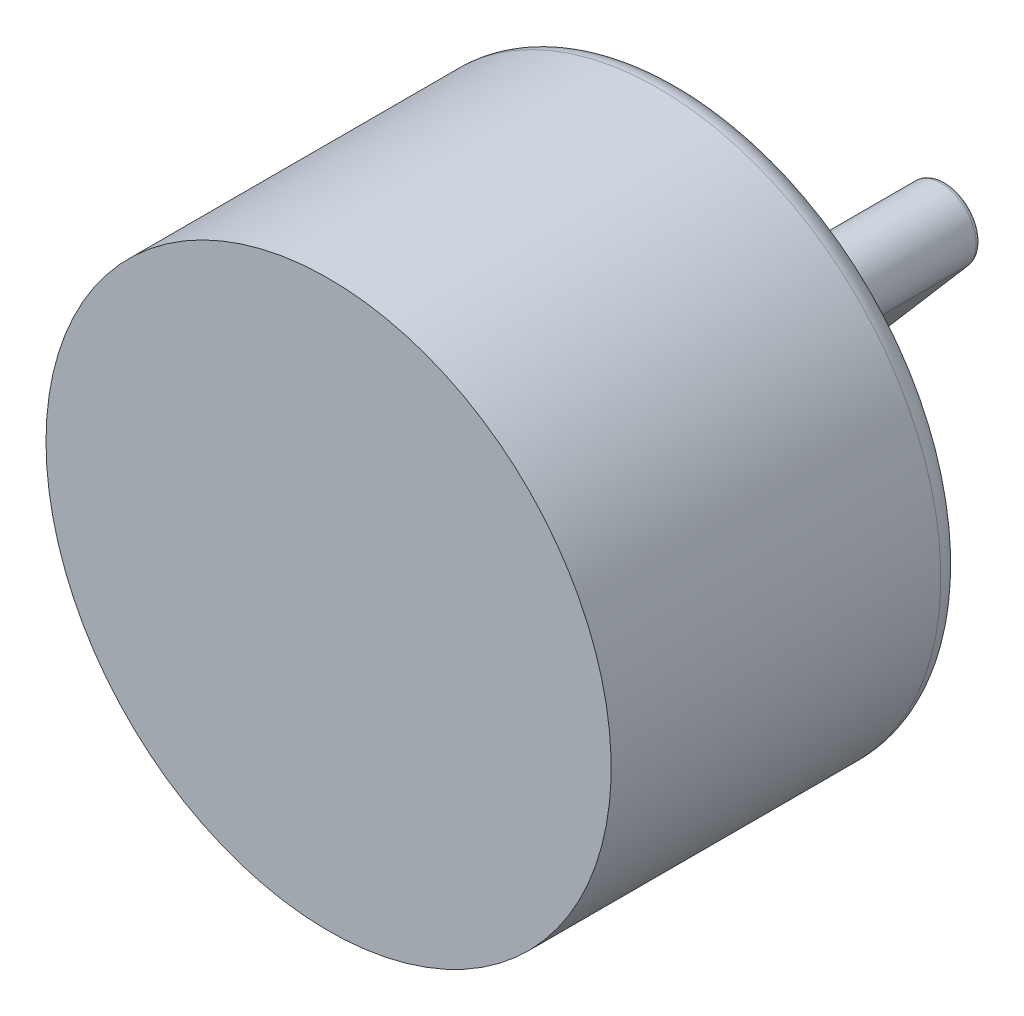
ISO-10303-21;
HEADER;
FILE_DESCRIPTION(('STEP AP214'),'2;1');
FILE_NAME('part.step','',(''),(''),'','','');
FILE_SCHEMA(('AUTOMOTIVE_DESIGN { 1 0 10303 214 1 1 1 1 }'));
ENDSEC;
DATA;
#1=APPLICATION_CONTEXT('core data for automotive mechanical design processes');
#2=APPLICATION_PROTOCOL_DEFINITION('international standard','automotive_design',2000,#1);
#3=PRODUCT_CONTEXT('',#1,'mechanical');
#4=PRODUCT('Part','Part','',(#3));
#5=PRODUCT_RELATED_PRODUCT_CATEGORY('part','',(#4));
#6=PRODUCT_DEFINITION_FORMATION('','',#4);
#7=PRODUCT_DEFINITION_CONTEXT('part definition',#1,'design');
#8=PRODUCT_DEFINITION('design','',#6,#7);
#9=PRODUCT_DEFINITION_SHAPE('','',#8);
#10=(LENGTH_UNIT() NAMED_UNIT(*) SI_UNIT(.MILLI.,.METRE.));
#11=(NAMED_UNIT(*) PLANE_ANGLE_UNIT() SI_UNIT($,.RADIAN.));
#12=(NAMED_UNIT(*) SI_UNIT($,.STERADIAN.) SOLID_ANGLE_UNIT());
#13=UNCERTAINTY_MEASURE_WITH_UNIT(LENGTH_MEASURE(1.E-05),#10,'distance_accuracy_value','');
#14=(GEOMETRIC_REPRESENTATION_CONTEXT(3) GLOBAL_UNCERTAINTY_ASSIGNED_CONTEXT((#13)) GLOBAL_UNIT_ASSIGNED_CONTEXT((#10,
#11,#12)) REPRESENTATION_CONTEXT('',''));
#15=CARTESIAN_POINT('',(0.,0.,0.));
#16=DIRECTION('',(0.,0.,1.));
#17=DIRECTION('',(1.,0.,0.));
#18=AXIS2_PLACEMENT_3D('',#15,#16,#17);
#19=CARTESIAN_POINT('',(-7.33178412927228,-6.22454347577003,-24.));
#20=DIRECTION('',(0.758171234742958,-0.65205550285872,0.));
#21=DIRECTION('',(0.65205550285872,0.758171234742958,0.));
#22=AXIS2_PLACEMENT_3D('',#19,#20,#21);
#23=PLANE('',#22);
#24=DIRECTION('',(0.,0.,1.));
#25=VECTOR('',#24,1.);
#26=CARTESIAN_POINT('',(5.0572704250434,8.18070998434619,-24.));
#27=LINE('',#26,#25);
#28=CARTESIAN_POINT('',(5.0572704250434,8.18070998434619,-23.8));
#29=VERTEX_POINT('',#28);
#30=CARTESIAN_POINT('',(5.0572704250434,8.18070998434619,-19.));
#31=VERTEX_POINT('',#30);
#32=EDGE_CURVE('E173',#29,#31,#27,.T.);
#33=ORIENTED_EDGE('',*,*,#32,.F.);
#34=DIRECTION('',(0.65205550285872,0.758171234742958,0.));
#35=VECTOR('',#34,1.);
#36=CARTESIAN_POINT('',(0.924723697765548,3.37563121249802,-23.8));
#37=LINE('',#36,#35);
#38=CARTESIAN_POINT('',(0.924723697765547,3.37563121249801,-23.8));
#39=VERTEX_POINT('',#38);
#40=EDGE_CURVE('E152',#29,#39,#37,.F.);
#41=ORIENTED_EDGE('',*,*,#40,.T.);
#42=DIRECTION('',(0.,0.,1.));
#43=VECTOR('',#42,1.);
#44=CARTESIAN_POINT('',(0.924723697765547,3.37563121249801,-24.));
#45=LINE('',#44,#43);
#46=CARTESIAN_POINT('',(0.924723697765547,3.37563121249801,-19.));
#47=VERTEX_POINT('',#46);
#48=EDGE_CURVE('E136',#47,#39,#45,.F.);
#49=ORIENTED_EDGE('',*,*,#48,.F.);
#50=DIRECTION('',(0.65205550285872,0.758171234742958,0.));
#51=VECTOR('',#50,1.);
#52=CARTESIAN_POINT('',(-7.33178412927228,-6.22454347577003,-19.));
#53=LINE('',#52,#51);
#54=EDGE_CURVE('E149',#47,#31,#53,.T.);
#55=ORIENTED_EDGE('',*,*,#54,.T.);
#56=EDGE_LOOP('',(#33,#41,#49,#55));
#57=FACE_BOUND('',#56,.T.);
#58=ADVANCED_FACE('F36',(#57),#23,.F.);
#59=DIRECTION('',(0.,0.,1.));
#60=VECTOR('',#59,1.);
#61=CARTESIAN_POINT('',(-3.19923740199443,-1.41946470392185,-24.));
#62=LINE('',#61,#60);
#63=CARTESIAN_POINT('',(-3.19923740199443,-1.41946470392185,-23.8));
#64=VERTEX_POINT('',#63);
#65=CARTESIAN_POINT('',(-3.19923740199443,-1.41946470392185,-19.));
#66=VERTEX_POINT('',#65);
#67=EDGE_CURVE('E139',#64,#66,#62,.T.);
#68=ORIENTED_EDGE('',*,*,#67,.F.);
#69=DIRECTION('',(0.65205550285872,0.758171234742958,0.));
#70=VECTOR('',#69,1.);
#71=CARTESIAN_POINT('',(-7.33178412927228,-6.22454347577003,-23.8));
#72=LINE('',#71,#70);
#73=CARTESIAN_POINT('',(-7.33178412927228,-6.22454347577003,-23.8));
#74=VERTEX_POINT('',#73);
#75=EDGE_CURVE('E210',#64,#74,#72,.F.);
#76=ORIENTED_EDGE('',*,*,#75,.T.);
#77=DIRECTION('',(0.,0.,1.));
#78=VECTOR('',#77,1.);
#79=CARTESIAN_POINT('',(-7.33178412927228,-6.22454347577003,-24.));
#80=LINE('',#79,#78);
#81=CARTESIAN_POINT('',(-7.33178412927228,-6.22454347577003,-19.));
#82=VERTEX_POINT('',#81);
#83=EDGE_CURVE('E175',#74,#82,#80,.T.);
#84=ORIENTED_EDGE('',*,*,#83,.T.);
#85=EDGE_CURVE('E158',#82,#66,#53,.T.);
#86=ORIENTED_EDGE('',*,*,#85,.T.);
#87=EDGE_LOOP('',(#68,#76,#84,#86));
#88=FACE_BOUND('',#87,.T.);
#89=ADVANCED_FACE('F282',(#88),#23,.F.);
#90=CARTESIAN_POINT('',(-5.05727042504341,-8.18070998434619,-24.));
#91=DIRECTION('',(-0.758171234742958,0.65205550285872,0.));
#92=DIRECTION('',(-0.65205550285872,-0.758171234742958,0.));
#93=AXIS2_PLACEMENT_3D('',#90,#91,#92);
#94=PLANE('',#93);
#95=DIRECTION('',(0.,0.,1.));
#96=VECTOR('',#95,1.);
#97=CARTESIAN_POINT('',(-5.05727042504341,-8.18070998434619,-24.));
#98=LINE('',#97,#96);
#99=CARTESIAN_POINT('',(-5.05727042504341,-8.18070998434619,-23.8));
#100=VERTEX_POINT('',#99);
#101=CARTESIAN_POINT('',(-5.05727042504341,-8.18070998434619,-19.));
#102=VERTEX_POINT('',#101);
#103=EDGE_CURVE('E169',#100,#102,#98,.T.);
#104=ORIENTED_EDGE('',*,*,#103,.F.);
#105=DIRECTION('',(-0.65205550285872,-0.758171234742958,0.));
#106=VECTOR('',#105,1.);
#107=CARTESIAN_POINT('',(-0.924723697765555,-3.37563121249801,-23.8));
#108=LINE('',#107,#106);
#109=CARTESIAN_POINT('',(-0.924723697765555,-3.37563121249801,-23.8));
#110=VERTEX_POINT('',#109);
#111=EDGE_CURVE('E60',#100,#110,#108,.F.);
#112=ORIENTED_EDGE('',*,*,#111,.T.);
#113=DIRECTION('',(0.,0.,1.));
#114=VECTOR('',#113,1.);
#115=CARTESIAN_POINT('',(-0.924723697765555,-3.37563121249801,-24.));
#116=LINE('',#115,#114);
#117=CARTESIAN_POINT('',(-0.924723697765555,-3.37563121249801,-19.));
#118=VERTEX_POINT('',#117);
#119=EDGE_CURVE('E360',#118,#110,#116,.F.);
#120=ORIENTED_EDGE('',*,*,#119,.F.);
#121=DIRECTION('',(-0.65205550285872,-0.758171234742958,0.));
#122=VECTOR('',#121,1.);
#123=CARTESIAN_POINT('',(-5.05727042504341,-8.18070998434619,-19.));
#124=LINE('',#123,#122);
#125=EDGE_CURVE('E165',#118,#102,#124,.T.);
#126=ORIENTED_EDGE('',*,*,#125,.T.);
#127=EDGE_LOOP('',(#104,#112,#120,#126));
#128=FACE_BOUND('',#127,.T.);
#129=ADVANCED_FACE('F287',(#128),#94,.F.);
#130=DIRECTION('',(0.,0.,1.));
#131=VECTOR('',#130,1.);
#132=CARTESIAN_POINT('',(3.19923740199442,1.41946470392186,-24.));
#133=LINE('',#132,#131);
#134=CARTESIAN_POINT('',(3.19923740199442,1.41946470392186,-23.8));
#135=VERTEX_POINT('',#134);
#136=CARTESIAN_POINT('',(3.19923740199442,1.41946470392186,-19.));
#137=VERTEX_POINT('',#136);
#138=EDGE_CURVE('E330',#135,#137,#133,.T.);
#139=ORIENTED_EDGE('',*,*,#138,.F.);
#140=DIRECTION('',(-0.65205550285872,-0.758171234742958,0.));
#141=VECTOR('',#140,1.);
#142=CARTESIAN_POINT('',(7.33178412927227,6.22454347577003,-23.8));
#143=LINE('',#142,#141);
#144=CARTESIAN_POINT('',(7.33178412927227,6.22454347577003,-23.8));
#145=VERTEX_POINT('',#144);
#146=EDGE_CURVE('E11',#135,#145,#143,.F.);
#147=ORIENTED_EDGE('',*,*,#146,.T.);
#148=DIRECTION('',(0.,0.,1.));
#149=VECTOR('',#148,1.);
#150=CARTESIAN_POINT('',(7.33178412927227,6.22454347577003,-24.));
#151=LINE('',#150,#149);
#152=CARTESIAN_POINT('',(7.33178412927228,6.22454347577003,-19.));
#153=VERTEX_POINT('',#152);
#154=EDGE_CURVE('E171',#145,#153,#151,.T.);
#155=ORIENTED_EDGE('',*,*,#154,.T.);
#156=EDGE_CURVE('E166',#153,#137,#124,.T.);
#157=ORIENTED_EDGE('',*,*,#156,.T.);
#158=EDGE_LOOP('',(#139,#147,#155,#157));
#159=FACE_BOUND('',#158,.T.);
#160=ADVANCED_FACE('F301',(#159),#94,.F.);
#161=CARTESIAN_POINT('',(0.,0.,-19.));
#162=DIRECTION('',(0.,0.,-1.));
#163=DIRECTION('',(-1.,0.,0.));
#164=AXIS2_PLACEMENT_3D('',#161,#162,#163);
#165=PLANE('',#164);
#166=ORIENTED_EDGE('',*,*,#54,.F.);
#167=CARTESIAN_POINT('',(0.,0.,-19.));
#168=DIRECTION('',(0.,0.,-1.));
#169=DIRECTION('',(-1.,0.,0.));
#170=AXIS2_PLACEMENT_3D('',#167,#168,#169);
#171=CIRCLE('',#170,3.5);
#172=EDGE_CURVE('E133',#66,#47,#171,.T.);
#173=ORIENTED_EDGE('',*,*,#172,.F.);
#174=ORIENTED_EDGE('',*,*,#85,.F.);
#175=CARTESIAN_POINT('',(-6.19452727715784,-7.20262673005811,-19.));
#176=DIRECTION('',(0.,0.,-1.));
#177=DIRECTION('',(-1.,0.,0.));
#178=AXIS2_PLACEMENT_3D('',#175,#176,#177);
#179=CIRCLE('',#178,1.5);
#180=CARTESIAN_POINT('',(-7.17261053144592,-8.33988358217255,-19.));
#181=VERTEX_POINT('',#180);
#182=EDGE_CURVE('E153',#181,#82,#179,.T.);
#183=ORIENTED_EDGE('',*,*,#182,.F.);
#184=CARTESIAN_POINT('',(0.,0.,-19.));
#185=DIRECTION('',(0.,0.,-1.));
#186=DIRECTION('',(-1.,0.,0.));
#187=AXIS2_PLACEMENT_3D('',#184,#185,#186);
#188=CIRCLE('',#187,11.);
#189=CARTESIAN_POINT('',(7.17261053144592,8.33988358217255,-19.));
#190=VERTEX_POINT('',#189);
#191=EDGE_CURVE('E180',#181,#190,#188,.T.);
#192=ORIENTED_EDGE('',*,*,#191,.T.);
#193=CARTESIAN_POINT('',(6.19452727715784,7.20262673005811,-19.));
#194=DIRECTION('',(0.,0.,-1.));
#195=DIRECTION('',(-1.,0.,0.));
#196=AXIS2_PLACEMENT_3D('',#193,#194,#195);
#197=CIRCLE('',#196,1.5);
#198=EDGE_CURVE('E157',#31,#190,#197,.T.);
#199=ORIENTED_EDGE('',*,*,#198,.F.);
#200=EDGE_LOOP('',(#166,#173,#174,#183,#192,#199));
#201=FACE_BOUND('',#200,.T.);
#202=ADVANCED_FACE('F155',(#201),#165,.T.);
#203=ORIENTED_EDGE('',*,*,#125,.F.);
#204=EDGE_CURVE('E144',#137,#118,#171,.T.);
#205=ORIENTED_EDGE('',*,*,#204,.F.);
#206=ORIENTED_EDGE('',*,*,#156,.F.);
#207=EDGE_CURVE('E161',#190,#153,#197,.T.);
#208=ORIENTED_EDGE('',*,*,#207,.F.);
#209=EDGE_CURVE('E181',#190,#181,#188,.T.);
#210=ORIENTED_EDGE('',*,*,#209,.T.);
#211=EDGE_CURVE('E159',#102,#181,#179,.T.);
#212=ORIENTED_EDGE('',*,*,#211,.F.);
#213=EDGE_LOOP('',(#203,#205,#206,#208,#210,#212));
#214=FACE_BOUND('',#213,.T.);
#215=ADVANCED_FACE('F300',(#214),#165,.T.);
#216=CARTESIAN_POINT('',(0.,0.,-19.));
#217=DIRECTION('',(0.,0.,1.));
#218=DIRECTION('',(1.,0.,0.));
#219=AXIS2_PLACEMENT_3D('',#216,#217,#218);
#220=CYLINDRICAL_SURFACE('',#219,12.);
#221=CARTESIAN_POINT('',(0.,0.,-18.));
#222=DIRECTION('',(0.,0.,-1.));
#223=DIRECTION('',(-1.,0.,0.));
#224=AXIS2_PLACEMENT_3D('',#221,#222,#223);
#225=CIRCLE('',#224,12.);
#226=CARTESIAN_POINT('',(-12.,0.,-18.));
#227=VERTEX_POINT('',#226);
#228=EDGE_CURVE('E184',#227,#227,#225,.F.);
#229=ORIENTED_EDGE('',*,*,#228,.T.);
#230=EDGE_LOOP('',(#229));
#231=FACE_BOUND('',#230,.T.);
#232=CARTESIAN_POINT('',(0.,0.,-4.));
#233=DIRECTION('',(0.,0.,-1.));
#234=DIRECTION('',(-1.,0.,0.));
#235=AXIS2_PLACEMENT_3D('',#232,#233,#234);
#236=CIRCLE('',#235,12.);
#237=CARTESIAN_POINT('',(-12.,0.,-4.));
#238=VERTEX_POINT('',#237);
#239=EDGE_CURVE('E177',#238,#238,#236,.T.);
#240=ORIENTED_EDGE('',*,*,#239,.T.);
#241=EDGE_LOOP('',(#240));
#242=FACE_BOUND('',#241,.T.);
#243=ADVANCED_FACE('F305',(#231,#242),#220,.T.);
#244=CARTESIAN_POINT('',(0.,0.,-4.));
#245=DIRECTION('',(0.,0.,-1.));
#246=DIRECTION('',(-1.,0.,0.));
#247=AXIS2_PLACEMENT_3D('',#244,#245,#246);
#248=PLANE('',#247);
#249=ORIENTED_EDGE('',*,*,#239,.F.);
#250=EDGE_LOOP('',(#249));
#251=FACE_BOUND('',#250,.T.);
#252=ADVANCED_FACE('F302',(#251),#248,.F.);
#253=CARTESIAN_POINT('',(0.,0.,-18.));
#254=DIRECTION('',(0.,0.,-1.));
#255=DIRECTION('',(-1.,0.,0.));
#256=AXIS2_PLACEMENT_3D('',#253,#254,#255);
#257=TOROIDAL_SURFACE('',#256,11.,1.);
#258=ORIENTED_EDGE('',*,*,#228,.F.);
#259=EDGE_LOOP('',(#258));
#260=FACE_BOUND('',#259,.T.);
#261=ORIENTED_EDGE('',*,*,#209,.F.);
#262=ORIENTED_EDGE('',*,*,#191,.F.);
#263=EDGE_LOOP('',(#261,#262));
#264=FACE_BOUND('',#263,.T.);
#265=ADVANCED_FACE('F296',(#260,#264),#257,.T.);
#266=CARTESIAN_POINT('',(-6.19452727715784,-7.20262673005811,-24.));
#267=DIRECTION('',(0.,0.,1.));
#268=DIRECTION('',(1.,0.,0.));
#269=AXIS2_PLACEMENT_3D('',#266,#267,#268);
#270=CYLINDRICAL_SURFACE('',#269,1.5);
#271=ORIENTED_EDGE('',*,*,#83,.F.);
#272=CARTESIAN_POINT('',(-6.19452727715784,-7.20262673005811,-23.8));
#273=DIRECTION('',(0.,0.,-1.));
#274=DIRECTION('',(-1.,0.,0.));
#275=AXIS2_PLACEMENT_3D('',#272,#273,#274);
#276=CIRCLE('',#275,1.5);
#277=EDGE_CURVE('E212',#74,#100,#276,.F.);
#278=ORIENTED_EDGE('',*,*,#277,.T.);
#279=ORIENTED_EDGE('',*,*,#103,.T.);
#280=ORIENTED_EDGE('',*,*,#211,.T.);
#281=ORIENTED_EDGE('',*,*,#182,.T.);
#282=EDGE_LOOP('',(#271,#278,#279,#280,#281));
#283=FACE_BOUND('',#282,.T.);
#284=ADVANCED_FACE('F293',(#283),#270,.T.);
#285=CARTESIAN_POINT('',(6.19452727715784,7.20262673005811,-24.));
#286=DIRECTION('',(0.,0.,1.));
#287=DIRECTION('',(1.,0.,0.));
#288=AXIS2_PLACEMENT_3D('',#285,#286,#287);
#289=CYLINDRICAL_SURFACE('',#288,1.5);
#290=ORIENTED_EDGE('',*,*,#154,.F.);
#291=CARTESIAN_POINT('',(6.19452727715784,7.20262673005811,-23.8));
#292=DIRECTION('',(0.,0.,-1.));
#293=DIRECTION('',(-1.,0.,0.));
#294=AXIS2_PLACEMENT_3D('',#291,#292,#293);
#295=CIRCLE('',#294,1.5);
#296=EDGE_CURVE('E204',#145,#29,#295,.F.);
#297=ORIENTED_EDGE('',*,*,#296,.T.);
#298=ORIENTED_EDGE('',*,*,#32,.T.);
#299=ORIENTED_EDGE('',*,*,#198,.T.);
#300=ORIENTED_EDGE('',*,*,#207,.T.);
#301=EDGE_LOOP('',(#290,#297,#298,#299,#300));
#302=FACE_BOUND('',#301,.T.);
#303=ADVANCED_FACE('F291',(#302),#289,.T.);
#304=CARTESIAN_POINT('',(-6.19452727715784,-7.20262673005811,-24.));
#305=DIRECTION('',(0.,0.,-1.));
#306=DIRECTION('',(-1.,0.,0.));
#307=AXIS2_PLACEMENT_3D('',#304,#305,#306);
#308=PLANE('',#307);
#309=DIRECTION('',(0.65205550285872,0.758171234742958,0.));
#310=VECTOR('',#309,1.);
#311=CARTESIAN_POINT('',(5.20890467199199,8.05029888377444,-24.));
#312=LINE('',#311,#310);
#313=CARTESIAN_POINT('',(0.992159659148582,3.14731936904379,-24.));
#314=VERTEX_POINT('',#313);
#315=CARTESIAN_POINT('',(5.20890467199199,8.05029888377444,-24.));
#316=VERTEX_POINT('',#315);
#317=EDGE_CURVE('E199',#314,#316,#312,.T.);
#318=ORIENTED_EDGE('',*,*,#317,.T.);
#319=CARTESIAN_POINT('',(6.19452727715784,7.20262673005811,-24.));
#320=DIRECTION('',(0.,0.,-1.));
#321=DIRECTION('',(-1.,0.,0.));
#322=AXIS2_PLACEMENT_3D('',#319,#320,#321);
#323=CIRCLE('',#322,1.3);
#324=CARTESIAN_POINT('',(7.18014988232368,6.35495457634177,-24.));
#325=VERTEX_POINT('',#324);
#326=EDGE_CURVE('E201',#316,#325,#323,.T.);
#327=ORIENTED_EDGE('',*,*,#326,.T.);
#328=DIRECTION('',(-0.65205550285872,-0.758171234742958,0.));
#329=VECTOR('',#328,1.);
#330=CARTESIAN_POINT('',(3.04760315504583,1.5498758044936,-24.));
#331=LINE('',#330,#329);
#332=CARTESIAN_POINT('',(2.96340486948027,1.45197506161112,-24.));
#333=VERTEX_POINT('',#332);
#334=EDGE_CURVE('E187',#325,#333,#331,.T.);
#335=ORIENTED_EDGE('',*,*,#334,.T.);
#336=CARTESIAN_POINT('',(0.,0.,-24.));
#337=DIRECTION('',(0.,0.,-1.));
#338=DIRECTION('',(-1.,0.,0.));
#339=AXIS2_PLACEMENT_3D('',#336,#337,#338);
#340=CIRCLE('',#339,3.3);
#341=CARTESIAN_POINT('',(-0.992159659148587,-3.14731936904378,-24.));
#342=VERTEX_POINT('',#341);
#343=EDGE_CURVE('E189',#333,#342,#340,.T.);
#344=ORIENTED_EDGE('',*,*,#343,.T.);
#345=DIRECTION('',(-0.65205550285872,-0.758171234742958,0.));
#346=VECTOR('',#345,1.);
#347=CARTESIAN_POINT('',(-5.208904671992,-8.05029888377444,-24.));
#348=LINE('',#347,#346);
#349=CARTESIAN_POINT('',(-5.208904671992,-8.05029888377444,-24.));
#350=VERTEX_POINT('',#349);
#351=EDGE_CURVE('E191',#342,#350,#348,.T.);
#352=ORIENTED_EDGE('',*,*,#351,.T.);
#353=CARTESIAN_POINT('',(-6.19452727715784,-7.20262673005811,-24.));
#354=DIRECTION('',(0.,0.,-1.));
#355=DIRECTION('',(-1.,0.,0.));
#356=AXIS2_PLACEMENT_3D('',#353,#354,#355);
#357=CIRCLE('',#356,1.3);
#358=CARTESIAN_POINT('',(-7.18014988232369,-6.35495457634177,-24.));
#359=VERTEX_POINT('',#358);
#360=EDGE_CURVE('E193',#350,#359,#357,.T.);
#361=ORIENTED_EDGE('',*,*,#360,.T.);
#362=DIRECTION('',(0.65205550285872,0.758171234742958,0.));
#363=VECTOR('',#362,1.);
#364=CARTESIAN_POINT('',(-3.04760315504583,-1.54987580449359,-24.));
#365=LINE('',#364,#363);
#366=CARTESIAN_POINT('',(-2.96340486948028,-1.45197506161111,-24.));
#367=VERTEX_POINT('',#366);
#368=EDGE_CURVE('E195',#359,#367,#365,.T.);
#369=ORIENTED_EDGE('',*,*,#368,.T.);
#370=CARTESIAN_POINT('',(0.,0.,-24.));
#371=DIRECTION('',(0.,0.,-1.));
#372=DIRECTION('',(-1.,0.,0.));
#373=AXIS2_PLACEMENT_3D('',#370,#371,#372);
#374=CIRCLE('',#373,3.3);
#375=EDGE_CURVE('E197',#367,#314,#374,.T.);
#376=ORIENTED_EDGE('',*,*,#375,.T.);
#377=EDGE_LOOP('',(#318,#327,#335,#344,#352,#361,#369,#376));
#378=FACE_BOUND('',#377,.T.);
#379=ADVANCED_FACE('F335',(#378),#308,.T.);
#380=CARTESIAN_POINT('',(0.,0.,-24.));
#381=DIRECTION('',(0.,0.,1.));
#382=DIRECTION('',(1.,0.,0.));
#383=AXIS2_PLACEMENT_3D('',#380,#381,#382);
#384=CYLINDRICAL_SURFACE('',#383,3.5);
#385=ORIENTED_EDGE('',*,*,#119,.T.);
#386=CARTESIAN_POINT('',(0.,0.,-23.8));
#387=DIRECTION('',(0.,0.,-1.));
#388=DIRECTION('',(-1.,0.,0.));
#389=AXIS2_PLACEMENT_3D('',#386,#387,#388);
#390=CIRCLE('',#389,3.5);
#391=EDGE_CURVE('E45',#110,#135,#390,.F.);
#392=ORIENTED_EDGE('',*,*,#391,.T.);
#393=ORIENTED_EDGE('',*,*,#138,.T.);
#394=ORIENTED_EDGE('',*,*,#204,.T.);
#395=EDGE_LOOP('',(#385,#392,#393,#394));
#396=FACE_BOUND('',#395,.T.);
#397=ADVANCED_FACE('F364',(#396),#384,.T.);
#398=ORIENTED_EDGE('',*,*,#48,.T.);
#399=CARTESIAN_POINT('',(0.,0.,-23.8));
#400=DIRECTION('',(0.,0.,-1.));
#401=DIRECTION('',(-1.,0.,0.));
#402=AXIS2_PLACEMENT_3D('',#399,#400,#401);
#403=CIRCLE('',#402,3.5);
#404=EDGE_CURVE('E208',#39,#64,#403,.F.);
#405=ORIENTED_EDGE('',*,*,#404,.T.);
#406=ORIENTED_EDGE('',*,*,#67,.T.);
#407=ORIENTED_EDGE('',*,*,#172,.T.);
#408=EDGE_LOOP('',(#398,#405,#406,#407));
#409=FACE_BOUND('',#408,.T.);
#410=ADVANCED_FACE('F135',(#409),#384,.T.);
#411=CARTESIAN_POINT('',(-6.19452727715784,-7.20262673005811,-23.8));
#412=DIRECTION('',(0.,0.,-1.));
#413=DIRECTION('',(-1.,0.,0.));
#414=AXIS2_PLACEMENT_3D('',#411,#412,#413);
#415=TOROIDAL_SURFACE('',#414,1.3,0.2);
#416=CARTESIAN_POINT('',(-5.208904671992,-8.05029888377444,-23.8));
#417=DIRECTION('',(0.652055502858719,0.758171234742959,0.));
#418=DIRECTION('',(-0.758171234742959,0.652055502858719,0.));
#419=AXIS2_PLACEMENT_3D('',#416,#417,#418);
#420=CIRCLE('',#419,0.2);
#421=EDGE_CURVE('E264',#100,#350,#420,.T.);
#422=ORIENTED_EDGE('',*,*,#421,.F.);
#423=ORIENTED_EDGE('',*,*,#277,.F.);
#424=CARTESIAN_POINT('',(-7.18014988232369,-6.35495457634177,-23.8));
#425=DIRECTION('',(0.652055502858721,0.758171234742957,0.));
#426=DIRECTION('',(-0.758171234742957,0.652055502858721,0.));
#427=AXIS2_PLACEMENT_3D('',#424,#425,#426);
#428=CIRCLE('',#427,0.2);
#429=EDGE_CURVE('E40',#359,#74,#428,.T.);
#430=ORIENTED_EDGE('',*,*,#429,.F.);
#431=ORIENTED_EDGE('',*,*,#360,.F.);
#432=EDGE_LOOP('',(#422,#423,#430,#431));
#433=FACE_BOUND('',#432,.T.);
#434=ADVANCED_FACE('F38',(#433),#415,.T.);
#435=CARTESIAN_POINT('',(-7.18014988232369,-6.35495457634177,-23.8));
#436=DIRECTION('',(-0.65205550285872,-0.758171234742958,0.));
#437=DIRECTION('',(0.758171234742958,-0.65205550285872,0.));
#438=AXIS2_PLACEMENT_3D('',#435,#436,#437);
#439=CYLINDRICAL_SURFACE('',#438,0.2);
#440=ORIENTED_EDGE('',*,*,#429,.T.);
#441=ORIENTED_EDGE('',*,*,#75,.F.);
#442=CARTESIAN_POINT('',(-3.19923740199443,-1.41946470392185,-23.8));
#443=CARTESIAN_POINT('',(-3.19925312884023,-1.41946204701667,-23.8100040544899));
#444=CARTESIAN_POINT('',(-3.19835991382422,-1.41959405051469,-23.8199955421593));
#445=CARTESIAN_POINT('',(-3.19488388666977,-1.42010588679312,-23.8396265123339));
#446=CARTESIAN_POINT('',(-3.19230913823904,-1.42048453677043,-23.8492674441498));
#447=CARTESIAN_POINT('',(-3.18559963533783,-1.42146803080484,-23.8679613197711));
#448=CARTESIAN_POINT('',(-3.18146649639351,-1.42207264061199,-23.8770148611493));
#449=CARTESIAN_POINT('',(-3.1718324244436,-1.42347552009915,-23.894350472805));
#450=CARTESIAN_POINT('',(-3.16633018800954,-1.42427397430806,-23.9026317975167));
#451=CARTESIAN_POINT('',(-3.15382621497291,-1.42607839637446,-23.9187189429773));
#452=CARTESIAN_POINT('',(-3.14675710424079,-1.42709356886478,-23.9264711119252));
#453=CARTESIAN_POINT('',(-3.13157968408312,-1.42925815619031,-23.9408513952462));
#454=CARTESIAN_POINT('',(-3.12347113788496,-1.43040760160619,-23.9474792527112));
#455=CARTESIAN_POINT('',(-3.10518988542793,-1.43297906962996,-23.9604517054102));
#456=CARTESIAN_POINT('',(-3.09488885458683,-1.43441634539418,-23.9666122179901));
#457=CARTESIAN_POINT('',(-3.0735072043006,-1.4373703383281,-23.9773767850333));
#458=CARTESIAN_POINT('',(-3.0624256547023,-1.43888714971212,-23.9819789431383));
#459=CARTESIAN_POINT('',(-3.03744416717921,-1.44227022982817,-23.9904020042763));
#460=CARTESIAN_POINT('',(-3.02342824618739,-1.44414501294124,-23.99387546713));
#461=CARTESIAN_POINT('',(-2.99504925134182,-1.44788901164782,-23.9985902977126));
#462=CARTESIAN_POINT('',(-2.98068689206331,-1.44975823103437,-23.9998359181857));
#463=CARTESIAN_POINT('',(-2.96535567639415,-1.45172515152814,-23.9999949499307));
#464=CARTESIAN_POINT('',(-2.96438022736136,-1.45185017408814,-24.0000000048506));
#465=CARTESIAN_POINT('',(-2.96340486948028,-1.45197506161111,-24.));
#466=B_SPLINE_CURVE_WITH_KNOTS('',3,(#442,#443,#444,#445,#446,#447,#448,#449,#450,#451,#452,
#453,#454,#455,#456,#457,#458,#459,#460,#461,#462,#463,#464,#465),.UNSPECIFIED.,.F.,.F.,(4,2,2,
2,2,2,2,2,2,2,2,4),(0.,0.0299517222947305,0.0597608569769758,0.0895391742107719,
0.119345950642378,0.150844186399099,0.182349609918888,0.218475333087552,0.254644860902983,
0.298145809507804,0.341563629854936,0.344513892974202),.UNSPECIFIED.);
#467=EDGE_CURVE('E258',#367,#64,#466,.F.);
#468=ORIENTED_EDGE('',*,*,#467,.F.);
#469=ORIENTED_EDGE('',*,*,#368,.F.);
#470=EDGE_LOOP('',(#440,#441,#468,#469));
#471=FACE_BOUND('',#470,.T.);
#472=ADVANCED_FACE('F270',(#471),#439,.T.);
#473=CARTESIAN_POINT('',(-5.208904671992,-8.05029888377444,-23.8));
#474=DIRECTION('',(0.65205550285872,0.758171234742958,0.));
#475=DIRECTION('',(-0.758171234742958,0.65205550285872,0.));
#476=AXIS2_PLACEMENT_3D('',#473,#474,#475);
#477=CYLINDRICAL_SURFACE('',#476,0.2);
#478=ORIENTED_EDGE('',*,*,#421,.T.);
#479=ORIENTED_EDGE('',*,*,#351,.F.);
#480=CARTESIAN_POINT('',(-0.924723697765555,-3.37563121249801,-23.8));
#481=CARTESIAN_POINT('',(-0.924718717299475,-3.37564636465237,-23.8100040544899));
#482=CARTESIAN_POINT('',(-0.924982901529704,-3.37478296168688,-23.8199955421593));
#483=CARTESIAN_POINT('',(-0.926009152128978,-3.3714226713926,-23.8396265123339));
#484=CARTESIAN_POINT('',(-0.926768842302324,-3.36893357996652,-23.8492674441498));
#485=CARTESIAN_POINT('',(-0.928745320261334,-3.36244680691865,-23.8679613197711));
#486=CARTESIAN_POINT('',(-0.929961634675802,-3.35845068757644,-23.8770148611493));
#487=CARTESIAN_POINT('',(-0.932790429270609,-3.34913503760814,-23.894350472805));
#488=CARTESIAN_POINT('',(-0.934403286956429,-3.34381424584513,-23.9026317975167));
#489=CARTESIAN_POINT('',(-0.938058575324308,-3.33172110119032,-23.9187189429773));
#490=CARTESIAN_POINT('',(-0.940120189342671,-3.32488351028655,-23.9264711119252));
#491=CARTESIAN_POINT('',(-0.944531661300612,-3.31020092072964,-23.9408513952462));
#492=CARTESIAN_POINT('',(-0.946881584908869,-3.3023556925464,-23.9474792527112));
#493=CARTESIAN_POINT('',(-0.952159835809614,-3.28466511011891,-23.9604517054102));
#494=CARTESIAN_POINT('',(-0.955122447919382,-3.27469515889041,-23.9666122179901));
#495=CARTESIAN_POINT('',(-0.961242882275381,-3.25399633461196,-23.9773767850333));
#496=CARTESIAN_POINT('',(-0.964400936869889,-3.24326655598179,-23.9819789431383));
#497=CARTESIAN_POINT('',(-0.971484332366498,-3.21907264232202,-23.9904020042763));
#498=CARTESIAN_POINT('',(-0.975435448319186,-3.20549510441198,-23.99387546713));
#499=CARTESIAN_POINT('',(-0.98338412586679,-3.17799595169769,-23.9985902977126));
#500=CARTESIAN_POINT('',(-0.987381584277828,-3.16407504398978,-23.9998359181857));
#501=CARTESIAN_POINT('',(-0.991620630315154,-3.14921081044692,-23.9999949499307));
#502=CARTESIAN_POINT('',(-0.99189021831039,-3.14826505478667,-24.0000000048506));
#503=CARTESIAN_POINT('',(-0.992159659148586,-3.14731936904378,-24.));
#504=B_SPLINE_CURVE_WITH_KNOTS('',3,(#480,#481,#482,#483,#484,#485,#486,#487,#488,#489,#490,
#491,#492,#493,#494,#495,#496,#497,#498,#499,#500,#501,#502,#503),.UNSPECIFIED.,.F.,.F.,(4,2,2,
2,2,2,2,2,2,2,2,4),(0.,0.0299517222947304,0.0597608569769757,0.0895391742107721,
0.119345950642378,0.150844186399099,0.182349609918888,0.218475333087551,0.254644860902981,
0.298145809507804,0.341563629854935,0.344513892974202),.UNSPECIFIED.);
#505=EDGE_CURVE('E265',#110,#342,#504,.T.);
#506=ORIENTED_EDGE('',*,*,#505,.F.);
#507=ORIENTED_EDGE('',*,*,#111,.F.);
#508=EDGE_LOOP('',(#478,#479,#506,#507));
#509=FACE_BOUND('',#508,.T.);
#510=ADVANCED_FACE('F253',(#509),#477,.T.);
#511=CARTESIAN_POINT('',(0.,0.,-23.8));
#512=DIRECTION('',(0.,0.,-1.));
#513=DIRECTION('',(-1.,0.,0.));
#514=AXIS2_PLACEMENT_3D('',#511,#512,#513);
#515=TOROIDAL_SURFACE('',#514,3.3,0.2);
#516=ORIENTED_EDGE('',*,*,#467,.T.);
#517=ORIENTED_EDGE('',*,*,#404,.F.);
#518=CARTESIAN_POINT('',(0.924723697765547,3.37563121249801,-23.8));
#519=CARTESIAN_POINT('',(0.924718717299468,3.37564636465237,-23.8100040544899));
#520=CARTESIAN_POINT('',(0.924982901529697,3.37478296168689,-23.8199955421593));
#521=CARTESIAN_POINT('',(0.926009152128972,3.3714226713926,-23.8396265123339));
#522=CARTESIAN_POINT('',(0.926768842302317,3.36893357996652,-23.8492674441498));
#523=CARTESIAN_POINT('',(0.928745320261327,3.36244680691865,-23.8679613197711));
#524=CARTESIAN_POINT('',(0.929961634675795,3.35845068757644,-23.8770148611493));
#525=CARTESIAN_POINT('',(0.932790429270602,3.34913503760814,-23.894350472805));
#526=CARTESIAN_POINT('',(0.934403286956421,3.34381424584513,-23.9026317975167));
#527=CARTESIAN_POINT('',(0.938058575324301,3.33172110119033,-23.9187189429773));
#528=CARTESIAN_POINT('',(0.940120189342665,3.32488351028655,-23.9264711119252));
#529=CARTESIAN_POINT('',(0.944531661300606,3.31020092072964,-23.9408513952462));
#530=CARTESIAN_POINT('',(0.946881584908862,3.3023556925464,-23.9474792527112));
#531=CARTESIAN_POINT('',(0.952159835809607,3.28466511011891,-23.9604517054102));
#532=CARTESIAN_POINT('',(0.955122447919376,3.27469515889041,-23.9666122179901));
#533=CARTESIAN_POINT('',(0.961242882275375,3.25399633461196,-23.9773767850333));
#534=CARTESIAN_POINT('',(0.964400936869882,3.24326655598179,-23.9819789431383));
#535=CARTESIAN_POINT('',(0.971484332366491,3.21907264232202,-23.9904020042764));
#536=CARTESIAN_POINT('',(0.97543544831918,3.20549510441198,-23.99387546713));
#537=CARTESIAN_POINT('',(0.983384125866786,3.17799595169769,-23.9985902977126));
#538=CARTESIAN_POINT('',(0.987381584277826,3.16407504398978,-23.9998359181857));
#539=CARTESIAN_POINT('',(0.991620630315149,3.14921081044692,-23.9999949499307));
#540=CARTESIAN_POINT('',(0.991890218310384,3.14826505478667,-24.0000000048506));
#541=CARTESIAN_POINT('',(0.99215965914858,3.14731936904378,-24.));
#542=B_SPLINE_CURVE_WITH_KNOTS('',3,(#518,#519,#520,#521,#522,#523,#524,#525,#526,#527,#528,
#529,#530,#531,#532,#533,#534,#535,#536,#537,#538,#539,#540,#541),.UNSPECIFIED.,.F.,.F.,(4,2,2,
2,2,2,2,2,2,2,2,4),(0.,0.0299517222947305,0.0597608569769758,0.0895391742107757,
0.119345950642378,0.150844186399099,0.182349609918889,0.218475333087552,0.254644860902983,
0.298145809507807,0.341563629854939,0.344513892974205),.UNSPECIFIED.);
#543=EDGE_CURVE('E229',#314,#39,#542,.F.);
#544=ORIENTED_EDGE('',*,*,#543,.F.);
#545=ORIENTED_EDGE('',*,*,#375,.F.);
#546=EDGE_LOOP('',(#516,#517,#544,#545));
#547=FACE_BOUND('',#546,.T.);
#548=ADVANCED_FACE('F249',(#547),#515,.T.);
#549=CARTESIAN_POINT('',(0.,0.,-23.8));
#550=DIRECTION('',(0.,0.,-1.));
#551=DIRECTION('',(-1.,0.,0.));
#552=AXIS2_PLACEMENT_3D('',#549,#550,#551);
#553=TOROIDAL_SURFACE('',#552,3.3,0.2);
#554=ORIENTED_EDGE('',*,*,#505,.T.);
#555=ORIENTED_EDGE('',*,*,#343,.F.);
#556=CARTESIAN_POINT('',(3.19923740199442,1.41946470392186,-23.8));
#557=CARTESIAN_POINT('',(3.19925312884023,1.41946204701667,-23.8100040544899));
#558=CARTESIAN_POINT('',(3.19835991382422,1.4195940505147,-23.8199955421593));
#559=CARTESIAN_POINT('',(3.19488388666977,1.42010588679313,-23.8396265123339));
#560=CARTESIAN_POINT('',(3.19230913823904,1.42048453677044,-23.8492674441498));
#561=CARTESIAN_POINT('',(3.18559963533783,1.42146803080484,-23.8679613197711));
#562=CARTESIAN_POINT('',(3.18146649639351,1.422072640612,-23.8770148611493));
#563=CARTESIAN_POINT('',(3.1718324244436,1.42347552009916,-23.894350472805));
#564=CARTESIAN_POINT('',(3.16633018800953,1.42427397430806,-23.9026317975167));
#565=CARTESIAN_POINT('',(3.15382621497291,1.42607839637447,-23.9187189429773));
#566=CARTESIAN_POINT('',(3.14675710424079,1.42709356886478,-23.9264711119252));
#567=CARTESIAN_POINT('',(3.13157968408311,1.42925815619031,-23.9408513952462));
#568=CARTESIAN_POINT('',(3.12347113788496,1.43040760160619,-23.9474792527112));
#569=CARTESIAN_POINT('',(3.10518988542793,1.43297906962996,-23.9604517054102));
#570=CARTESIAN_POINT('',(3.09488885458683,1.43441634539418,-23.9666122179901));
#571=CARTESIAN_POINT('',(3.0735072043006,1.4373703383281,-23.9773767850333));
#572=CARTESIAN_POINT('',(3.0624256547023,1.43888714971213,-23.9819789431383));
#573=CARTESIAN_POINT('',(3.03744416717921,1.44227022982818,-23.9904020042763));
#574=CARTESIAN_POINT('',(3.02342824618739,1.44414501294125,-23.99387546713));
#575=CARTESIAN_POINT('',(2.99504925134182,1.44788901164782,-23.9985902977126));
#576=CARTESIAN_POINT('',(2.9806868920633,1.44975823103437,-23.9998359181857));
#577=CARTESIAN_POINT('',(2.96535567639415,1.45172515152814,-23.9999949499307));
#578=CARTESIAN_POINT('',(2.96438022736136,1.45185017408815,-24.0000000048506));
#579=CARTESIAN_POINT('',(2.96340486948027,1.45197506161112,-24.));
#580=B_SPLINE_CURVE_WITH_KNOTS('',3,(#556,#557,#558,#559,#560,#561,#562,#563,#564,#565,#566,
#567,#568,#569,#570,#571,#572,#573,#574,#575,#576,#577,#578,#579),.UNSPECIFIED.,.F.,.F.,(4,2,2,
2,2,2,2,2,2,2,2,4),(0.,0.0299517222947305,0.0597608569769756,0.0895391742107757,
0.119345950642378,0.150844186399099,0.182349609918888,0.218475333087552,0.254644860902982,
0.298145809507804,0.341563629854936,0.344513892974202),.UNSPECIFIED.);
#581=EDGE_CURVE('E220',#135,#333,#580,.T.);
#582=ORIENTED_EDGE('',*,*,#581,.F.);
#583=ORIENTED_EDGE('',*,*,#391,.F.);
#584=EDGE_LOOP('',(#554,#555,#582,#583));
#585=FACE_BOUND('',#584,.T.);
#586=ADVANCED_FACE('F237',(#585),#553,.T.);
#587=CARTESIAN_POINT('',(-7.18014988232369,-6.35495457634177,-23.8));
#588=DIRECTION('',(-0.65205550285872,-0.758171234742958,0.));
#589=DIRECTION('',(0.758171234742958,-0.65205550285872,0.));
#590=AXIS2_PLACEMENT_3D('',#587,#588,#589);
#591=CYLINDRICAL_SURFACE('',#590,0.2);
#592=ORIENTED_EDGE('',*,*,#543,.T.);
#593=ORIENTED_EDGE('',*,*,#40,.F.);
#594=CARTESIAN_POINT('',(5.20890467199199,8.05029888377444,-23.8));
#595=DIRECTION('',(0.652055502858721,0.758171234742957,0.));
#596=DIRECTION('',(-0.758171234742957,0.652055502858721,0.));
#597=AXIS2_PLACEMENT_3D('',#594,#595,#596);
#598=CIRCLE('',#597,0.2);
#599=EDGE_CURVE('E218',#316,#29,#598,.T.);
#600=ORIENTED_EDGE('',*,*,#599,.F.);
#601=ORIENTED_EDGE('',*,*,#317,.F.);
#602=EDGE_LOOP('',(#592,#593,#600,#601));
#603=FACE_BOUND('',#602,.T.);
#604=ADVANCED_FACE('F244',(#603),#591,.T.);
#605=CARTESIAN_POINT('',(-5.208904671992,-8.05029888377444,-23.8));
#606=DIRECTION('',(0.65205550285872,0.758171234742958,0.));
#607=DIRECTION('',(-0.758171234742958,0.65205550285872,0.));
#608=AXIS2_PLACEMENT_3D('',#605,#606,#607);
#609=CYLINDRICAL_SURFACE('',#608,0.2);
#610=ORIENTED_EDGE('',*,*,#581,.T.);
#611=ORIENTED_EDGE('',*,*,#334,.F.);
#612=CARTESIAN_POINT('',(7.18014988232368,6.35495457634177,-23.8));
#613=DIRECTION('',(0.652055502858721,0.758171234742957,0.));
#614=DIRECTION('',(-0.758171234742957,0.652055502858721,0.));
#615=AXIS2_PLACEMENT_3D('',#612,#613,#614);
#616=CIRCLE('',#615,0.2);
#617=EDGE_CURVE('E216',#145,#325,#616,.T.);
#618=ORIENTED_EDGE('',*,*,#617,.F.);
#619=ORIENTED_EDGE('',*,*,#146,.F.);
#620=EDGE_LOOP('',(#610,#611,#618,#619));
#621=FACE_BOUND('',#620,.T.);
#622=ADVANCED_FACE('F240',(#621),#609,.T.);
#623=CARTESIAN_POINT('',(6.19452727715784,7.20262673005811,-23.8));
#624=DIRECTION('',(0.,0.,-1.));
#625=DIRECTION('',(-1.,0.,0.));
#626=AXIS2_PLACEMENT_3D('',#623,#624,#625);
#627=TOROIDAL_SURFACE('',#626,1.3,0.2);
#628=ORIENTED_EDGE('',*,*,#599,.T.);
#629=ORIENTED_EDGE('',*,*,#296,.F.);
#630=ORIENTED_EDGE('',*,*,#617,.T.);
#631=ORIENTED_EDGE('',*,*,#326,.F.);
#632=EDGE_LOOP('',(#628,#629,#630,#631));
#633=FACE_BOUND('',#632,.T.);
#634=ADVANCED_FACE('F243',(#633),#627,.T.);
#635=CLOSED_SHELL('',(#58,#89,#129,#160,#202,#215,#243,#252,#265,#284,#303,#379,#397,#410,#434,
#472,#510,#548,#586,#604,#622,#634));
#636=MANIFOLD_SOLID_BREP('B2',#635);
#637=ADVANCED_BREP_SHAPE_REPRESENTATION('',(#18,#636),#14);
#638=SHAPE_DEFINITION_REPRESENTATION(#9,#637);
ENDSEC;
END-ISO-10303-21;
